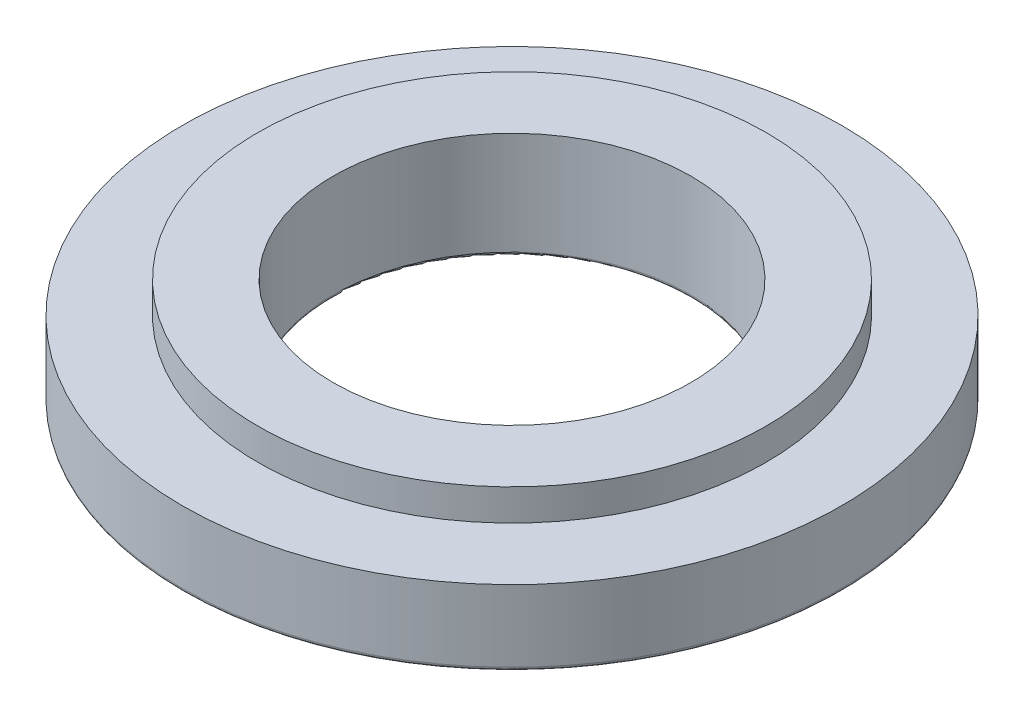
from build123d import *

# Parameters (mm, degrees)
FILLET1_R = 0.15


with BuildPart() as part:
    # Sketch1 → Revolve1 (revolve)
    with BuildSketch(Plane.XY, mode=Mode.PRIVATE) as revolve1_sk:
        Polygon((7.125, 0), (7.125, 4.25), (10.125, 4.25), (10.125, 3), (13.125, 3), (13.125, 0), align=None)
    revolve(revolve1_sk.sketch.rotate(Axis((0, 0, 0), (0, 1, 0)), 90), axis=Axis((0, 0, 0), (0, 1, 0)))

    # Fillet1
    fillet1_edges = [part.edges().sort_by_distance(p)[0] for p in [
        (0, 0, 13.125),
        (0, 0, 7.125),
    ]]
    fillet(fillet1_edges, radius=FILLET1_R)


solid = part.part
